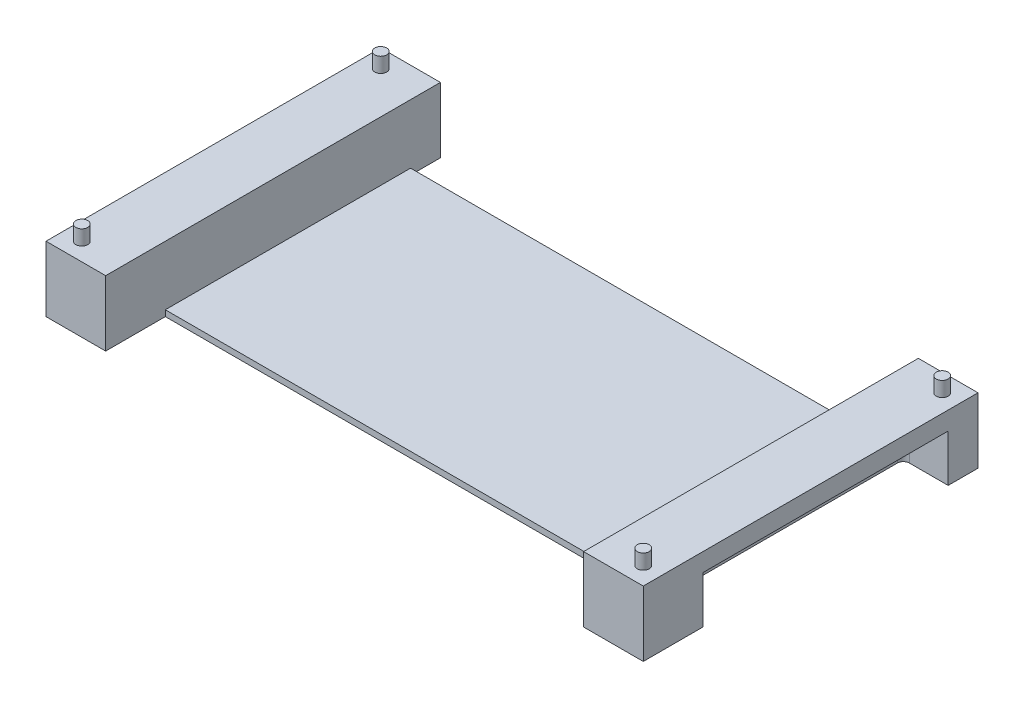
ISO-10303-21;
HEADER;
FILE_DESCRIPTION(('STEP AP214'),'2;1');
FILE_NAME('part.step','',(''),(''),'','','');
FILE_SCHEMA(('AUTOMOTIVE_DESIGN { 1 0 10303 214 1 1 1 1 }'));
ENDSEC;
DATA;
#1=APPLICATION_CONTEXT('core data for automotive mechanical design processes');
#2=APPLICATION_PROTOCOL_DEFINITION('international standard','automotive_design',2000,#1);
#3=PRODUCT_CONTEXT('',#1,'mechanical');
#4=PRODUCT('Part','Part','',(#3));
#5=PRODUCT_RELATED_PRODUCT_CATEGORY('part','',(#4));
#6=PRODUCT_DEFINITION_FORMATION('','',#4);
#7=PRODUCT_DEFINITION_CONTEXT('part definition',#1,'design');
#8=PRODUCT_DEFINITION('design','',#6,#7);
#9=PRODUCT_DEFINITION_SHAPE('','',#8);
#10=(LENGTH_UNIT() NAMED_UNIT(*) SI_UNIT(.MILLI.,.METRE.));
#11=(NAMED_UNIT(*) PLANE_ANGLE_UNIT() SI_UNIT($,.RADIAN.));
#12=(NAMED_UNIT(*) SI_UNIT($,.STERADIAN.) SOLID_ANGLE_UNIT());
#13=UNCERTAINTY_MEASURE_WITH_UNIT(LENGTH_MEASURE(1.E-05),#10,'distance_accuracy_value','');
#14=(GEOMETRIC_REPRESENTATION_CONTEXT(3) GLOBAL_UNCERTAINTY_ASSIGNED_CONTEXT((#13)) GLOBAL_UNIT_ASSIGNED_CONTEXT((#10,
#11,#12)) REPRESENTATION_CONTEXT('',''));
#15=CARTESIAN_POINT('',(0.,0.,0.));
#16=DIRECTION('',(0.,0.,1.));
#17=DIRECTION('',(1.,0.,0.));
#18=AXIS2_PLACEMENT_3D('',#15,#16,#17);
#19=CARTESIAN_POINT('',(80.1,3.05,0.));
#20=DIRECTION('',(1.,0.,0.));
#21=DIRECTION('',(0.,0.,-1.));
#22=AXIS2_PLACEMENT_3D('',#19,#20,#21);
#23=PLANE('',#22);
#24=DIRECTION('',(0.,-1.,0.));
#25=VECTOR('',#24,1.);
#26=CARTESIAN_POINT('',(80.1,-6.9,-41.1));
#27=LINE('',#26,#25);
#28=CARTESIAN_POINT('',(80.1,-6.9,-41.1));
#29=VERTEX_POINT('',#28);
#30=CARTESIAN_POINT('',(80.1,-7.9,-41.1));
#31=VERTEX_POINT('',#30);
#32=EDGE_CURVE('E328',#29,#31,#27,.T.);
#33=ORIENTED_EDGE('',*,*,#32,.F.);
#34=DIRECTION('',(0.,0.,1.));
#35=VECTOR('',#34,1.);
#36=CARTESIAN_POINT('',(80.1,-6.9,0.));
#37=LINE('',#36,#35);
#38=CARTESIAN_POINT('',(80.1,-6.9,0.));
#39=VERTEX_POINT('',#38);
#40=EDGE_CURVE('E310',#29,#39,#37,.T.);
#41=ORIENTED_EDGE('',*,*,#40,.T.);
#42=DIRECTION('',(0.,-1.,0.));
#43=VECTOR('',#42,1.);
#44=CARTESIAN_POINT('',(80.1,-6.9,0.));
#45=LINE('',#44,#43);
#46=CARTESIAN_POINT('',(80.1,-7.9,0.));
#47=VERTEX_POINT('',#46);
#48=EDGE_CURVE('E330',#39,#47,#45,.T.);
#49=ORIENTED_EDGE('',*,*,#48,.T.);
#50=DIRECTION('',(0.,0.,1.));
#51=VECTOR('',#50,1.);
#52=CARTESIAN_POINT('',(80.1,-7.9,0.));
#53=LINE('',#52,#51);
#54=CARTESIAN_POINT('',(80.1,-7.9,10.));
#55=VERTEX_POINT('',#54);
#56=EDGE_CURVE('E347',#47,#55,#53,.T.);
#57=ORIENTED_EDGE('',*,*,#56,.T.);
#58=DIRECTION('',(0.,-1.,0.));
#59=VECTOR('',#58,1.);
#60=CARTESIAN_POINT('',(80.1,3.05,10.));
#61=LINE('',#60,#59);
#62=CARTESIAN_POINT('',(80.1,3.05,10.));
#63=VERTEX_POINT('',#62);
#64=EDGE_CURVE('E365',#63,#55,#61,.T.);
#65=ORIENTED_EDGE('',*,*,#64,.F.);
#66=DIRECTION('',(0.,0.,1.));
#67=VECTOR('',#66,1.);
#68=CARTESIAN_POINT('',(80.1,3.05,0.));
#69=LINE('',#68,#67);
#70=CARTESIAN_POINT('',(80.1,3.05,-46.1));
#71=VERTEX_POINT('',#70);
#72=EDGE_CURVE('E381',#71,#63,#69,.T.);
#73=ORIENTED_EDGE('',*,*,#72,.F.);
#74=DIRECTION('',(0.,-1.,0.));
#75=VECTOR('',#74,1.);
#76=CARTESIAN_POINT('',(80.1,3.05,-46.1));
#77=LINE('',#76,#75);
#78=CARTESIAN_POINT('',(80.1,-7.9,-46.1));
#79=VERTEX_POINT('',#78);
#80=EDGE_CURVE('E374',#71,#79,#77,.T.);
#81=ORIENTED_EDGE('',*,*,#80,.T.);
#82=EDGE_CURVE('E348',#79,#31,#53,.T.);
#83=ORIENTED_EDGE('',*,*,#82,.T.);
#84=EDGE_LOOP('',(#33,#41,#49,#57,#65,#73,#81,#83));
#85=FACE_BOUND('',#84,.T.);
#86=ADVANCED_FACE('F67',(#85),#23,.F.);
#87=CARTESIAN_POINT('',(0.,0.,0.));
#88=DIRECTION('',(0.,1.,0.));
#89=DIRECTION('',(0.,0.,1.));
#90=AXIS2_PLACEMENT_3D('',#87,#88,#89);
#91=PLANE('',#90);
#92=DIRECTION('',(1.,0.,0.));
#93=VECTOR('',#92,1.);
#94=CARTESIAN_POINT('',(0.,0.,0.));
#95=LINE('',#94,#93);
#96=CARTESIAN_POINT('',(83.6,0.,0.));
#97=VERTEX_POINT('',#96);
#98=CARTESIAN_POINT('',(90.1,0.,0.));
#99=VERTEX_POINT('',#98);
#100=EDGE_CURVE('E333',#97,#99,#95,.T.);
#101=ORIENTED_EDGE('',*,*,#100,.F.);
#102=CARTESIAN_POINT('',(83.6,0.,-1.));
#103=DIRECTION('',(0.,1.,0.));
#104=DIRECTION('',(0.,0.,1.));
#105=AXIS2_PLACEMENT_3D('',#102,#103,#104);
#106=CIRCLE('',#105,1.);
#107=CARTESIAN_POINT('',(82.6,0.,-1.));
#108=VERTEX_POINT('',#107);
#109=EDGE_CURVE('E406',#97,#108,#106,.F.);
#110=ORIENTED_EDGE('',*,*,#109,.T.);
#111=DIRECTION('',(0.,0.,1.));
#112=VECTOR('',#111,1.);
#113=CARTESIAN_POINT('',(82.6,0.,0.));
#114=LINE('',#113,#112);
#115=CARTESIAN_POINT('',(82.6,0.,-40.1));
#116=VERTEX_POINT('',#115);
#117=EDGE_CURVE('E359',#116,#108,#114,.T.);
#118=ORIENTED_EDGE('',*,*,#117,.F.);
#119=CARTESIAN_POINT('',(83.6,0.,-40.1));
#120=DIRECTION('',(0.,1.,0.));
#121=DIRECTION('',(0.,0.,1.));
#122=AXIS2_PLACEMENT_3D('',#119,#120,#121);
#123=CIRCLE('',#122,1.);
#124=CARTESIAN_POINT('',(83.6,0.,-41.1));
#125=VERTEX_POINT('',#124);
#126=EDGE_CURVE('E404',#116,#125,#123,.F.);
#127=ORIENTED_EDGE('',*,*,#126,.T.);
#128=DIRECTION('',(1.,0.,0.));
#129=VECTOR('',#128,1.);
#130=CARTESIAN_POINT('',(0.,0.,-41.1));
#131=LINE('',#130,#129);
#132=CARTESIAN_POINT('',(90.1,0.,-41.1));
#133=VERTEX_POINT('',#132);
#134=EDGE_CURVE('E337',#125,#133,#131,.T.);
#135=ORIENTED_EDGE('',*,*,#134,.T.);
#136=DIRECTION('',(0.,0.,-1.));
#137=VECTOR('',#136,1.);
#138=CARTESIAN_POINT('',(90.1,0.,0.));
#139=LINE('',#138,#137);
#140=EDGE_CURVE('E377',#99,#133,#139,.T.);
#141=ORIENTED_EDGE('',*,*,#140,.F.);
#142=EDGE_LOOP('',(#101,#110,#118,#127,#135,#141));
#143=FACE_BOUND('',#142,.T.);
#144=ADVANCED_FACE('F428',(#143),#91,.F.);
#145=CARTESIAN_POINT('',(0.,3.05,10.));
#146=DIRECTION('',(0.,0.,-1.));
#147=DIRECTION('',(-1.,0.,0.));
#148=AXIS2_PLACEMENT_3D('',#145,#146,#147);
#149=PLANE('',#148);
#150=ORIENTED_EDGE('',*,*,#64,.T.);
#151=DIRECTION('',(1.,0.,0.));
#152=VECTOR('',#151,1.);
#153=CARTESIAN_POINT('',(0.,-7.9,10.));
#154=LINE('',#153,#152);
#155=CARTESIAN_POINT('',(90.1,-7.9,10.));
#156=VERTEX_POINT('',#155);
#157=EDGE_CURVE('E351',#55,#156,#154,.T.);
#158=ORIENTED_EDGE('',*,*,#157,.T.);
#159=DIRECTION('',(0.,-1.,0.));
#160=VECTOR('',#159,1.);
#161=CARTESIAN_POINT('',(90.1,3.05,10.));
#162=LINE('',#161,#160);
#163=CARTESIAN_POINT('',(90.1,3.05,10.));
#164=VERTEX_POINT('',#163);
#165=EDGE_CURVE('E370',#164,#156,#162,.T.);
#166=ORIENTED_EDGE('',*,*,#165,.F.);
#167=DIRECTION('',(1.,0.,0.));
#168=VECTOR('',#167,1.);
#169=CARTESIAN_POINT('',(0.,3.05,10.));
#170=LINE('',#169,#168);
#171=EDGE_CURVE('E385',#63,#164,#170,.T.);
#172=ORIENTED_EDGE('',*,*,#171,.F.);
#173=EDGE_LOOP('',(#150,#158,#166,#172));
#174=FACE_BOUND('',#173,.T.);
#175=ADVANCED_FACE('F445',(#174),#149,.F.);
#176=CARTESIAN_POINT('',(90.1,3.05,0.));
#177=DIRECTION('',(-1.,0.,0.));
#178=DIRECTION('',(0.,0.,1.));
#179=AXIS2_PLACEMENT_3D('',#176,#177,#178);
#180=PLANE('',#179);
#181=ORIENTED_EDGE('',*,*,#165,.T.);
#182=DIRECTION('',(0.,0.,-1.));
#183=VECTOR('',#182,1.);
#184=CARTESIAN_POINT('',(90.1,-7.9,0.));
#185=LINE('',#184,#183);
#186=CARTESIAN_POINT('',(90.1,-7.9,0.));
#187=VERTEX_POINT('',#186);
#188=EDGE_CURVE('E354',#156,#187,#185,.T.);
#189=ORIENTED_EDGE('',*,*,#188,.T.);
#190=DIRECTION('',(0.,1.,0.));
#191=VECTOR('',#190,1.);
#192=CARTESIAN_POINT('',(90.1,-7.9,0.));
#193=LINE('',#192,#191);
#194=EDGE_CURVE('E362',#187,#99,#193,.T.);
#195=ORIENTED_EDGE('',*,*,#194,.T.);
#196=ORIENTED_EDGE('',*,*,#140,.T.);
#197=DIRECTION('',(0.,1.,0.));
#198=VECTOR('',#197,1.);
#199=CARTESIAN_POINT('',(90.1,-7.9,-41.1));
#200=LINE('',#199,#198);
#201=CARTESIAN_POINT('',(90.1,-7.9,-41.1));
#202=VERTEX_POINT('',#201);
#203=EDGE_CURVE('E357',#202,#133,#200,.T.);
#204=ORIENTED_EDGE('',*,*,#203,.F.);
#205=DIRECTION('',(0.,0.,-1.));
#206=VECTOR('',#205,1.);
#207=CARTESIAN_POINT('',(90.1,-7.9,0.));
#208=LINE('',#207,#206);
#209=CARTESIAN_POINT('',(90.1,-7.9,-46.1));
#210=VERTEX_POINT('',#209);
#211=EDGE_CURVE('E341',#202,#210,#208,.T.);
#212=ORIENTED_EDGE('',*,*,#211,.T.);
#213=DIRECTION('',(0.,-1.,0.));
#214=VECTOR('',#213,1.);
#215=CARTESIAN_POINT('',(90.1,3.05,-46.1));
#216=LINE('',#215,#214);
#217=CARTESIAN_POINT('',(90.1,3.05,-46.1));
#218=VERTEX_POINT('',#217);
#219=EDGE_CURVE('E372',#218,#210,#216,.T.);
#220=ORIENTED_EDGE('',*,*,#219,.F.);
#221=DIRECTION('',(0.,0.,-1.));
#222=VECTOR('',#221,1.);
#223=CARTESIAN_POINT('',(90.1,3.05,0.));
#224=LINE('',#223,#222);
#225=EDGE_CURVE('E383',#164,#218,#224,.T.);
#226=ORIENTED_EDGE('',*,*,#225,.F.);
#227=EDGE_LOOP('',(#181,#189,#195,#196,#204,#212,#220,#226));
#228=FACE_BOUND('',#227,.T.);
#229=ADVANCED_FACE('F438',(#228),#180,.F.);
#230=CARTESIAN_POINT('',(0.,3.05,-46.1));
#231=DIRECTION('',(0.,0.,1.));
#232=DIRECTION('',(1.,0.,0.));
#233=AXIS2_PLACEMENT_3D('',#230,#231,#232);
#234=PLANE('',#233);
#235=ORIENTED_EDGE('',*,*,#219,.T.);
#236=DIRECTION('',(-1.,0.,0.));
#237=VECTOR('',#236,1.);
#238=CARTESIAN_POINT('',(0.,-7.9,-46.1));
#239=LINE('',#238,#237);
#240=EDGE_CURVE('E344',#210,#79,#239,.T.);
#241=ORIENTED_EDGE('',*,*,#240,.T.);
#242=ORIENTED_EDGE('',*,*,#80,.F.);
#243=DIRECTION('',(-1.,0.,0.));
#244=VECTOR('',#243,1.);
#245=CARTESIAN_POINT('',(0.,3.05,-46.1));
#246=LINE('',#245,#244);
#247=EDGE_CURVE('E376',#218,#71,#246,.T.);
#248=ORIENTED_EDGE('',*,*,#247,.F.);
#249=EDGE_LOOP('',(#235,#241,#242,#248));
#250=FACE_BOUND('',#249,.T.);
#251=ADVANCED_FACE('F511',(#250),#234,.F.);
#252=CARTESIAN_POINT('',(0.,3.05,0.));
#253=DIRECTION('',(0.,1.,0.));
#254=DIRECTION('',(0.,0.,1.));
#255=AXIS2_PLACEMENT_3D('',#252,#253,#254);
#256=PLANE('',#255);
#257=CARTESIAN_POINT('',(87.1,3.05,-43.1));
#258=DIRECTION('',(0.,1.,0.));
#259=DIRECTION('',(0.,0.,1.));
#260=AXIS2_PLACEMENT_3D('',#257,#258,#259);
#261=CIRCLE('',#260,1.00000000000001);
#262=CARTESIAN_POINT('',(87.1,3.05,-42.1));
#263=VERTEX_POINT('',#262);
#264=EDGE_CURVE('E524',#263,#263,#261,.T.);
#265=ORIENTED_EDGE('',*,*,#264,.F.);
#266=EDGE_LOOP('',(#265));
#267=FACE_BOUND('',#266,.T.);
#268=CARTESIAN_POINT('',(87.1,3.05,7.));
#269=DIRECTION('',(0.,1.,0.));
#270=DIRECTION('',(0.,0.,1.));
#271=AXIS2_PLACEMENT_3D('',#268,#269,#270);
#272=CIRCLE('',#271,1.00000000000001);
#273=CARTESIAN_POINT('',(87.1,3.05,8.00000000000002));
#274=VERTEX_POINT('',#273);
#275=EDGE_CURVE('E528',#274,#274,#272,.T.);
#276=ORIENTED_EDGE('',*,*,#275,.F.);
#277=EDGE_LOOP('',(#276));
#278=FACE_BOUND('',#277,.T.);
#279=ORIENTED_EDGE('',*,*,#72,.T.);
#280=ORIENTED_EDGE('',*,*,#171,.T.);
#281=ORIENTED_EDGE('',*,*,#225,.T.);
#282=ORIENTED_EDGE('',*,*,#247,.T.);
#283=EDGE_LOOP('',(#279,#280,#281,#282));
#284=FACE_BOUND('',#283,.T.);
#285=ADVANCED_FACE('F513',(#267,#278,#284),#256,.T.);
#286=CARTESIAN_POINT('',(0.,-7.9,0.));
#287=DIRECTION('',(0.,0.,1.));
#288=DIRECTION('',(1.,0.,0.));
#289=AXIS2_PLACEMENT_3D('',#286,#287,#288);
#290=PLANE('',#289);
#291=DIRECTION('',(1.,0.,0.));
#292=VECTOR('',#291,1.);
#293=CARTESIAN_POINT('',(0.,-7.9,0.));
#294=LINE('',#293,#292);
#295=CARTESIAN_POINT('',(83.6,-7.9,0.));
#296=VERTEX_POINT('',#295);
#297=EDGE_CURVE('E334',#296,#187,#294,.T.);
#298=ORIENTED_EDGE('',*,*,#297,.F.);
#299=DIRECTION('',(0.,1.,0.));
#300=VECTOR('',#299,1.);
#301=CARTESIAN_POINT('',(83.6,0.,0.));
#302=LINE('',#301,#300);
#303=EDGE_CURVE('E401',#296,#97,#302,.T.);
#304=ORIENTED_EDGE('',*,*,#303,.T.);
#305=ORIENTED_EDGE('',*,*,#100,.T.);
#306=ORIENTED_EDGE('',*,*,#194,.F.);
#307=EDGE_LOOP('',(#298,#304,#305,#306));
#308=FACE_BOUND('',#307,.T.);
#309=ADVANCED_FACE('F423',(#308),#290,.F.);
#310=CARTESIAN_POINT('',(0.,-7.9,-41.1));
#311=DIRECTION('',(0.,0.,1.));
#312=DIRECTION('',(1.,0.,0.));
#313=AXIS2_PLACEMENT_3D('',#310,#311,#312);
#314=PLANE('',#313);
#315=ORIENTED_EDGE('',*,*,#134,.F.);
#316=DIRECTION('',(0.,1.,0.));
#317=VECTOR('',#316,1.);
#318=CARTESIAN_POINT('',(83.6,-7.9,-41.1));
#319=LINE('',#318,#317);
#320=CARTESIAN_POINT('',(83.6,-7.9,-41.1));
#321=VERTEX_POINT('',#320);
#322=EDGE_CURVE('E82',#125,#321,#319,.F.);
#323=ORIENTED_EDGE('',*,*,#322,.T.);
#324=DIRECTION('',(1.,0.,0.));
#325=VECTOR('',#324,1.);
#326=CARTESIAN_POINT('',(0.,-7.9,-41.1));
#327=LINE('',#326,#325);
#328=EDGE_CURVE('E339',#321,#202,#327,.T.);
#329=ORIENTED_EDGE('',*,*,#328,.T.);
#330=ORIENTED_EDGE('',*,*,#203,.T.);
#331=EDGE_LOOP('',(#315,#323,#329,#330));
#332=FACE_BOUND('',#331,.T.);
#333=ADVANCED_FACE('F434',(#332),#314,.T.);
#334=CARTESIAN_POINT('',(82.6,-7.9,0.));
#335=DIRECTION('',(-1.,0.,0.));
#336=DIRECTION('',(0.,0.,1.));
#337=AXIS2_PLACEMENT_3D('',#334,#335,#336);
#338=PLANE('',#337);
#339=ORIENTED_EDGE('',*,*,#117,.T.);
#340=DIRECTION('',(0.,1.,0.));
#341=VECTOR('',#340,1.);
#342=CARTESIAN_POINT('',(82.6,-7.9,-1.));
#343=LINE('',#342,#341);
#344=CARTESIAN_POINT('',(82.6,-7.9,-1.));
#345=VERTEX_POINT('',#344);
#346=EDGE_CURVE('E90',#108,#345,#343,.F.);
#347=ORIENTED_EDGE('',*,*,#346,.T.);
#348=DIRECTION('',(0.,0.,1.));
#349=VECTOR('',#348,1.);
#350=CARTESIAN_POINT('',(82.6,-7.9,0.));
#351=LINE('',#350,#349);
#352=CARTESIAN_POINT('',(82.6,-7.9,-40.1));
#353=VERTEX_POINT('',#352);
#354=EDGE_CURVE('E336',#353,#345,#351,.T.);
#355=ORIENTED_EDGE('',*,*,#354,.F.);
#356=DIRECTION('',(0.,1.,0.));
#357=VECTOR('',#356,1.);
#358=CARTESIAN_POINT('',(82.6,-7.9,-40.1));
#359=LINE('',#358,#357);
#360=EDGE_CURVE('E408',#353,#116,#359,.T.);
#361=ORIENTED_EDGE('',*,*,#360,.T.);
#362=EDGE_LOOP('',(#339,#347,#355,#361));
#363=FACE_BOUND('',#362,.T.);
#364=ADVANCED_FACE('F430',(#363),#338,.F.);
#365=CARTESIAN_POINT('',(0.,-7.9,0.));
#366=DIRECTION('',(0.,1.,0.));
#367=DIRECTION('',(0.,0.,1.));
#368=AXIS2_PLACEMENT_3D('',#365,#366,#367);
#369=PLANE('',#368);
#370=CARTESIAN_POINT('',(-7.,-7.9,-43.1));
#371=DIRECTION('',(0.,1.,0.));
#372=DIRECTION('',(0.,0.,1.));
#373=AXIS2_PLACEMENT_3D('',#370,#371,#372);
#374=CIRCLE('',#373,1.);
#375=CARTESIAN_POINT('',(-7.,-7.9,-42.1));
#376=VERTEX_POINT('',#375);
#377=EDGE_CURVE('E1018',#376,#376,#374,.T.);
#378=ORIENTED_EDGE('',*,*,#377,.T.);
#379=EDGE_LOOP('',(#378));
#380=FACE_BOUND('',#379,.T.);
#381=CARTESIAN_POINT('',(-7.,-7.9,7.));
#382=DIRECTION('',(0.,1.,0.));
#383=DIRECTION('',(0.,0.,1.));
#384=AXIS2_PLACEMENT_3D('',#381,#382,#383);
#385=CIRCLE('',#384,1.);
#386=CARTESIAN_POINT('',(-7.,-7.9,8.));
#387=VERTEX_POINT('',#386);
#388=EDGE_CURVE('E1024',#387,#387,#385,.T.);
#389=ORIENTED_EDGE('',*,*,#388,.T.);
#390=EDGE_LOOP('',(#389));
#391=FACE_BOUND('',#390,.T.);
#392=CARTESIAN_POINT('',(87.1,-7.9,-43.1));
#393=DIRECTION('',(0.,1.,0.));
#394=DIRECTION('',(0.,0.,1.));
#395=AXIS2_PLACEMENT_3D('',#392,#393,#394);
#396=CIRCLE('',#395,1.00000000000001);
#397=CARTESIAN_POINT('',(87.1,-7.9,-42.1));
#398=VERTEX_POINT('',#397);
#399=EDGE_CURVE('E1030',#398,#398,#396,.T.);
#400=ORIENTED_EDGE('',*,*,#399,.T.);
#401=EDGE_LOOP('',(#400));
#402=FACE_BOUND('',#401,.T.);
#403=CARTESIAN_POINT('',(87.1,-7.9,7.));
#404=DIRECTION('',(0.,1.,0.));
#405=DIRECTION('',(0.,0.,1.));
#406=AXIS2_PLACEMENT_3D('',#403,#404,#405);
#407=CIRCLE('',#406,1.00000000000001);
#408=CARTESIAN_POINT('',(87.1,-7.9,8.00000000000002));
#409=VERTEX_POINT('',#408);
#410=EDGE_CURVE('E262',#409,#409,#407,.T.);
#411=ORIENTED_EDGE('',*,*,#410,.T.);
#412=EDGE_LOOP('',(#411));
#413=FACE_BOUND('',#412,.T.);
#414=ORIENTED_EDGE('',*,*,#354,.T.);
#415=CARTESIAN_POINT('',(83.6,-7.9,-1.));
#416=DIRECTION('',(0.,1.,0.));
#417=DIRECTION('',(0.,0.,1.));
#418=AXIS2_PLACEMENT_3D('',#415,#416,#417);
#419=CIRCLE('',#418,1.);
#420=EDGE_CURVE('E75',#345,#296,#419,.T.);
#421=ORIENTED_EDGE('',*,*,#420,.T.);
#422=ORIENTED_EDGE('',*,*,#297,.T.);
#423=ORIENTED_EDGE('',*,*,#188,.F.);
#424=ORIENTED_EDGE('',*,*,#157,.F.);
#425=ORIENTED_EDGE('',*,*,#56,.F.);
#426=DIRECTION('',(1.,0.,0.));
#427=VECTOR('',#426,1.);
#428=CARTESIAN_POINT('',(0.,-7.9,0.));
#429=LINE('',#428,#427);
#430=CARTESIAN_POINT('',(0.,-7.9,0.));
#431=VERTEX_POINT('',#430);
#432=EDGE_CURVE('E307',#431,#47,#429,.T.);
#433=ORIENTED_EDGE('',*,*,#432,.F.);
#434=DIRECTION('',(0.,0.,1.));
#435=VECTOR('',#434,1.);
#436=CARTESIAN_POINT('',(0.,-7.9,0.));
#437=LINE('',#436,#435);
#438=CARTESIAN_POINT('',(0.,-7.9,10.));
#439=VERTEX_POINT('',#438);
#440=EDGE_CURVE('E266',#431,#439,#437,.T.);
#441=ORIENTED_EDGE('',*,*,#440,.T.);
#442=DIRECTION('',(-1.,0.,0.));
#443=VECTOR('',#442,1.);
#444=CARTESIAN_POINT('',(0.,-7.9,10.));
#445=LINE('',#444,#443);
#446=CARTESIAN_POINT('',(-10.,-7.9,10.));
#447=VERTEX_POINT('',#446);
#448=EDGE_CURVE('E238',#439,#447,#445,.T.);
#449=ORIENTED_EDGE('',*,*,#448,.T.);
#450=DIRECTION('',(0.,0.,-1.));
#451=VECTOR('',#450,1.);
#452=CARTESIAN_POINT('',(-10.,-7.9,0.));
#453=LINE('',#452,#451);
#454=CARTESIAN_POINT('',(-10.,-7.9,0.));
#455=VERTEX_POINT('',#454);
#456=EDGE_CURVE('E231',#447,#455,#453,.T.);
#457=ORIENTED_EDGE('',*,*,#456,.T.);
#458=DIRECTION('',(1.,0.,0.));
#459=VECTOR('',#458,1.);
#460=CARTESIAN_POINT('',(0.,-7.9,0.));
#461=LINE('',#460,#459);
#462=CARTESIAN_POINT('',(-3.5,-7.9,0.));
#463=VERTEX_POINT('',#462);
#464=EDGE_CURVE('E235',#455,#463,#461,.T.);
#465=ORIENTED_EDGE('',*,*,#464,.T.);
#466=CARTESIAN_POINT('',(-3.5,-7.9,-1.));
#467=DIRECTION('',(0.,1.,0.));
#468=DIRECTION('',(0.,0.,1.));
#469=AXIS2_PLACEMENT_3D('',#466,#467,#468);
#470=CIRCLE('',#469,1.);
#471=CARTESIAN_POINT('',(-2.5,-7.9,-1.));
#472=VERTEX_POINT('',#471);
#473=EDGE_CURVE('E413',#463,#472,#470,.T.);
#474=ORIENTED_EDGE('',*,*,#473,.T.);
#475=DIRECTION('',(0.,0.,1.));
#476=VECTOR('',#475,1.);
#477=CARTESIAN_POINT('',(-2.5,-7.9,0.));
#478=LINE('',#477,#476);
#479=CARTESIAN_POINT('',(-2.5,-7.9,-40.1));
#480=VERTEX_POINT('',#479);
#481=EDGE_CURVE('E251',#480,#472,#478,.T.);
#482=ORIENTED_EDGE('',*,*,#481,.F.);
#483=CARTESIAN_POINT('',(-3.5,-7.9,-40.1));
#484=DIRECTION('',(0.,1.,0.));
#485=DIRECTION('',(0.,0.,1.));
#486=AXIS2_PLACEMENT_3D('',#483,#484,#485);
#487=CIRCLE('',#486,1.);
#488=CARTESIAN_POINT('',(-3.5,-7.9,-41.1));
#489=VERTEX_POINT('',#488);
#490=EDGE_CURVE('E415',#480,#489,#487,.T.);
#491=ORIENTED_EDGE('',*,*,#490,.T.);
#492=DIRECTION('',(-1.,0.,0.));
#493=VECTOR('',#492,1.);
#494=CARTESIAN_POINT('',(0.,-7.9,-41.1));
#495=LINE('',#494,#493);
#496=CARTESIAN_POINT('',(-10.,-7.9,-41.1));
#497=VERTEX_POINT('',#496);
#498=EDGE_CURVE('E276',#489,#497,#495,.T.);
#499=ORIENTED_EDGE('',*,*,#498,.T.);
#500=DIRECTION('',(0.,0.,-1.));
#501=VECTOR('',#500,1.);
#502=CARTESIAN_POINT('',(-10.,-7.9,0.));
#503=LINE('',#502,#501);
#504=CARTESIAN_POINT('',(-10.,-7.9,-46.1));
#505=VERTEX_POINT('',#504);
#506=EDGE_CURVE('E273',#497,#505,#503,.T.);
#507=ORIENTED_EDGE('',*,*,#506,.T.);
#508=DIRECTION('',(1.,0.,0.));
#509=VECTOR('',#508,1.);
#510=CARTESIAN_POINT('',(0.,-7.9,-46.1));
#511=LINE('',#510,#509);
#512=CARTESIAN_POINT('',(0.,-7.9,-46.1));
#513=VERTEX_POINT('',#512);
#514=EDGE_CURVE('E270',#505,#513,#511,.T.);
#515=ORIENTED_EDGE('',*,*,#514,.T.);
#516=CARTESIAN_POINT('',(0.,-7.9,-41.1));
#517=VERTEX_POINT('',#516);
#518=EDGE_CURVE('E267',#513,#517,#437,.T.);
#519=ORIENTED_EDGE('',*,*,#518,.T.);
#520=DIRECTION('',(1.,0.,0.));
#521=VECTOR('',#520,1.);
#522=CARTESIAN_POINT('',(0.,-7.9,-41.1));
#523=LINE('',#522,#521);
#524=EDGE_CURVE('E311',#517,#31,#523,.T.);
#525=ORIENTED_EDGE('',*,*,#524,.T.);
#526=ORIENTED_EDGE('',*,*,#82,.F.);
#527=ORIENTED_EDGE('',*,*,#240,.F.);
#528=ORIENTED_EDGE('',*,*,#211,.F.);
#529=ORIENTED_EDGE('',*,*,#328,.F.);
#530=CARTESIAN_POINT('',(83.6,-7.9,-40.1));
#531=DIRECTION('',(0.,1.,0.));
#532=DIRECTION('',(0.,0.,1.));
#533=AXIS2_PLACEMENT_3D('',#530,#531,#532);
#534=CIRCLE('',#533,1.);
#535=EDGE_CURVE('E12',#321,#353,#534,.T.);
#536=ORIENTED_EDGE('',*,*,#535,.T.);
#537=EDGE_LOOP('',(#414,#421,#422,#423,#424,#425,#433,#441,#449,#457,#465,#474,#482,#491,#499,
#507,#515,#519,#525,#526,#527,#528,#529,#536));
#538=FACE_BOUND('',#537,.T.);
#539=ADVANCED_FACE('F233',(#380,#391,#402,#413,#538),#369,.F.);
#540=CARTESIAN_POINT('',(0.,-6.9,0.));
#541=DIRECTION('',(0.,0.,-1.));
#542=DIRECTION('',(-1.,0.,0.));
#543=AXIS2_PLACEMENT_3D('',#540,#541,#542);
#544=PLANE('',#543);
#545=ORIENTED_EDGE('',*,*,#432,.T.);
#546=ORIENTED_EDGE('',*,*,#48,.F.);
#547=DIRECTION('',(1.,0.,0.));
#548=VECTOR('',#547,1.);
#549=CARTESIAN_POINT('',(0.,-6.9,0.));
#550=LINE('',#549,#548);
#551=CARTESIAN_POINT('',(0.,-6.9,0.));
#552=VERTEX_POINT('',#551);
#553=EDGE_CURVE('E308',#552,#39,#550,.T.);
#554=ORIENTED_EDGE('',*,*,#553,.F.);
#555=DIRECTION('',(0.,-1.,0.));
#556=VECTOR('',#555,1.);
#557=CARTESIAN_POINT('',(0.,-6.9,0.));
#558=LINE('',#557,#556);
#559=EDGE_CURVE('E320',#552,#431,#558,.T.);
#560=ORIENTED_EDGE('',*,*,#559,.T.);
#561=EDGE_LOOP('',(#545,#546,#554,#560));
#562=FACE_BOUND('',#561,.T.);
#563=ADVANCED_FACE('F452',(#562),#544,.F.);
#564=CARTESIAN_POINT('',(0.,-6.9,-41.1));
#565=DIRECTION('',(0.,0.,-1.));
#566=DIRECTION('',(-1.,0.,0.));
#567=AXIS2_PLACEMENT_3D('',#564,#565,#566);
#568=PLANE('',#567);
#569=ORIENTED_EDGE('',*,*,#524,.F.);
#570=DIRECTION('',(0.,-1.,0.));
#571=VECTOR('',#570,1.);
#572=CARTESIAN_POINT('',(0.,-6.9,-41.1));
#573=LINE('',#572,#571);
#574=CARTESIAN_POINT('',(0.,-6.9,-41.1));
#575=VERTEX_POINT('',#574);
#576=EDGE_CURVE('E325',#575,#517,#573,.T.);
#577=ORIENTED_EDGE('',*,*,#576,.F.);
#578=DIRECTION('',(1.,0.,0.));
#579=VECTOR('',#578,1.);
#580=CARTESIAN_POINT('',(0.,-6.9,-41.1));
#581=LINE('',#580,#579);
#582=EDGE_CURVE('E314',#575,#29,#581,.T.);
#583=ORIENTED_EDGE('',*,*,#582,.T.);
#584=ORIENTED_EDGE('',*,*,#32,.T.);
#585=EDGE_LOOP('',(#569,#577,#583,#584));
#586=FACE_BOUND('',#585,.T.);
#587=ADVANCED_FACE('F535',(#586),#568,.T.);
#588=CARTESIAN_POINT('',(0.,-6.9,0.));
#589=DIRECTION('',(0.,-1.,0.));
#590=DIRECTION('',(0.,0.,-1.));
#591=AXIS2_PLACEMENT_3D('',#588,#589,#590);
#592=PLANE('',#591);
#593=ORIENTED_EDGE('',*,*,#553,.T.);
#594=ORIENTED_EDGE('',*,*,#40,.F.);
#595=ORIENTED_EDGE('',*,*,#582,.F.);
#596=DIRECTION('',(0.,0.,-1.));
#597=VECTOR('',#596,1.);
#598=CARTESIAN_POINT('',(0.,-6.9,0.));
#599=LINE('',#598,#597);
#600=EDGE_CURVE('E317',#552,#575,#599,.T.);
#601=ORIENTED_EDGE('',*,*,#600,.F.);
#602=EDGE_LOOP('',(#593,#594,#595,#601));
#603=FACE_BOUND('',#602,.T.);
#604=ADVANCED_FACE('F538',(#603),#592,.F.);
#605=CARTESIAN_POINT('',(0.,3.05,0.));
#606=DIRECTION('',(1.,0.,0.));
#607=DIRECTION('',(0.,0.,-1.));
#608=AXIS2_PLACEMENT_3D('',#605,#606,#607);
#609=PLANE('',#608);
#610=ORIENTED_EDGE('',*,*,#559,.F.);
#611=ORIENTED_EDGE('',*,*,#600,.T.);
#612=ORIENTED_EDGE('',*,*,#576,.T.);
#613=ORIENTED_EDGE('',*,*,#518,.F.);
#614=DIRECTION('',(0.,-1.,0.));
#615=VECTOR('',#614,1.);
#616=CARTESIAN_POINT('',(0.,3.05,-46.1));
#617=LINE('',#616,#615);
#618=CARTESIAN_POINT('',(0.,3.05,-46.1));
#619=VERTEX_POINT('',#618);
#620=EDGE_CURVE('E300',#619,#513,#617,.T.);
#621=ORIENTED_EDGE('',*,*,#620,.F.);
#622=DIRECTION('',(0.,0.,1.));
#623=VECTOR('',#622,1.);
#624=CARTESIAN_POINT('',(0.,3.05,0.));
#625=LINE('',#624,#623);
#626=CARTESIAN_POINT('',(0.,3.05,10.));
#627=VERTEX_POINT('',#626);
#628=EDGE_CURVE('E291',#619,#627,#625,.T.);
#629=ORIENTED_EDGE('',*,*,#628,.T.);
#630=DIRECTION('',(0.,-1.,0.));
#631=VECTOR('',#630,1.);
#632=CARTESIAN_POINT('',(0.,3.05,10.));
#633=LINE('',#632,#631);
#634=EDGE_CURVE('E302',#627,#439,#633,.T.);
#635=ORIENTED_EDGE('',*,*,#634,.T.);
#636=ORIENTED_EDGE('',*,*,#440,.F.);
#637=EDGE_LOOP('',(#610,#611,#612,#613,#621,#629,#635,#636));
#638=FACE_BOUND('',#637,.T.);
#639=ADVANCED_FACE('F457',(#638),#609,.T.);
#640=CARTESIAN_POINT('',(0.,0.,0.));
#641=DIRECTION('',(0.,1.,0.));
#642=DIRECTION('',(0.,0.,1.));
#643=AXIS2_PLACEMENT_3D('',#640,#641,#642);
#644=PLANE('',#643);
#645=DIRECTION('',(0.,0.,1.));
#646=VECTOR('',#645,1.);
#647=CARTESIAN_POINT('',(-2.5,0.,0.));
#648=LINE('',#647,#646);
#649=CARTESIAN_POINT('',(-2.5,0.,-40.1));
#650=VERTEX_POINT('',#649);
#651=CARTESIAN_POINT('',(-2.5,0.,-1.));
#652=VERTEX_POINT('',#651);
#653=EDGE_CURVE('E256',#650,#652,#648,.T.);
#654=ORIENTED_EDGE('',*,*,#653,.T.);
#655=CARTESIAN_POINT('',(-3.5,0.,-1.));
#656=DIRECTION('',(0.,1.,0.));
#657=DIRECTION('',(0.,0.,1.));
#658=AXIS2_PLACEMENT_3D('',#655,#656,#657);
#659=CIRCLE('',#658,1.);
#660=CARTESIAN_POINT('',(-3.5,0.,0.));
#661=VERTEX_POINT('',#660);
#662=EDGE_CURVE('E395',#652,#661,#659,.F.);
#663=ORIENTED_EDGE('',*,*,#662,.T.);
#664=DIRECTION('',(1.,0.,0.));
#665=VECTOR('',#664,1.);
#666=CARTESIAN_POINT('',(0.,0.,0.));
#667=LINE('',#666,#665);
#668=CARTESIAN_POINT('',(-10.,0.,0.));
#669=VERTEX_POINT('',#668);
#670=EDGE_CURVE('E280',#669,#661,#667,.T.);
#671=ORIENTED_EDGE('',*,*,#670,.F.);
#672=DIRECTION('',(0.,0.,-1.));
#673=VECTOR('',#672,1.);
#674=CARTESIAN_POINT('',(-10.,0.,0.));
#675=LINE('',#674,#673);
#676=CARTESIAN_POINT('',(-10.,0.,-41.1));
#677=VERTEX_POINT('',#676);
#678=EDGE_CURVE('E246',#669,#677,#675,.T.);
#679=ORIENTED_EDGE('',*,*,#678,.T.);
#680=DIRECTION('',(-1.,0.,0.));
#681=VECTOR('',#680,1.);
#682=CARTESIAN_POINT('',(0.,0.,-41.1));
#683=LINE('',#682,#681);
#684=CARTESIAN_POINT('',(-3.5,0.,-41.1));
#685=VERTEX_POINT('',#684);
#686=EDGE_CURVE('E259',#685,#677,#683,.T.);
#687=ORIENTED_EDGE('',*,*,#686,.F.);
#688=CARTESIAN_POINT('',(-3.5,0.,-40.1));
#689=DIRECTION('',(0.,1.,0.));
#690=DIRECTION('',(0.,0.,1.));
#691=AXIS2_PLACEMENT_3D('',#688,#689,#690);
#692=CIRCLE('',#691,1.);
#693=EDGE_CURVE('E393',#685,#650,#692,.F.);
#694=ORIENTED_EDGE('',*,*,#693,.T.);
#695=EDGE_LOOP('',(#654,#663,#671,#679,#687,#694));
#696=FACE_BOUND('',#695,.T.);
#697=ADVANCED_FACE('F480',(#696),#644,.F.);
#698=CARTESIAN_POINT('',(-10.,3.05,0.));
#699=DIRECTION('',(-1.,0.,0.));
#700=DIRECTION('',(0.,0.,1.));
#701=AXIS2_PLACEMENT_3D('',#698,#699,#700);
#702=PLANE('',#701);
#703=ORIENTED_EDGE('',*,*,#678,.F.);
#704=DIRECTION('',(0.,1.,0.));
#705=VECTOR('',#704,1.);
#706=CARTESIAN_POINT('',(-10.,-7.9,0.));
#707=LINE('',#706,#705);
#708=EDGE_CURVE('E242',#455,#669,#707,.T.);
#709=ORIENTED_EDGE('',*,*,#708,.F.);
#710=ORIENTED_EDGE('',*,*,#456,.F.);
#711=DIRECTION('',(0.,-1.,0.));
#712=VECTOR('',#711,1.);
#713=CARTESIAN_POINT('',(-10.,3.05,10.));
#714=LINE('',#713,#712);
#715=CARTESIAN_POINT('',(-10.,3.05,10.));
#716=VERTEX_POINT('',#715);
#717=EDGE_CURVE('E305',#716,#447,#714,.T.);
#718=ORIENTED_EDGE('',*,*,#717,.F.);
#719=DIRECTION('',(0.,0.,-1.));
#720=VECTOR('',#719,1.);
#721=CARTESIAN_POINT('',(-10.,3.05,0.));
#722=LINE('',#721,#720);
#723=CARTESIAN_POINT('',(-10.,3.05,-46.1));
#724=VERTEX_POINT('',#723);
#725=EDGE_CURVE('E285',#716,#724,#722,.T.);
#726=ORIENTED_EDGE('',*,*,#725,.T.);
#727=DIRECTION('',(0.,-1.,0.));
#728=VECTOR('',#727,1.);
#729=CARTESIAN_POINT('',(-10.,3.05,-46.1));
#730=LINE('',#729,#728);
#731=EDGE_CURVE('E297',#724,#505,#730,.T.);
#732=ORIENTED_EDGE('',*,*,#731,.T.);
#733=ORIENTED_EDGE('',*,*,#506,.F.);
#734=DIRECTION('',(0.,1.,0.));
#735=VECTOR('',#734,1.);
#736=CARTESIAN_POINT('',(-10.,-7.9,-41.1));
#737=LINE('',#736,#735);
#738=EDGE_CURVE('E250',#497,#677,#737,.T.);
#739=ORIENTED_EDGE('',*,*,#738,.T.);
#740=EDGE_LOOP('',(#703,#709,#710,#718,#726,#732,#733,#739));
#741=FACE_BOUND('',#740,.T.);
#742=ADVANCED_FACE('F243',(#741),#702,.T.);
#743=CARTESIAN_POINT('',(0.,3.05,10.));
#744=DIRECTION('',(0.,0.,1.));
#745=DIRECTION('',(1.,0.,0.));
#746=AXIS2_PLACEMENT_3D('',#743,#744,#745);
#747=PLANE('',#746);
#748=ORIENTED_EDGE('',*,*,#717,.T.);
#749=ORIENTED_EDGE('',*,*,#448,.F.);
#750=ORIENTED_EDGE('',*,*,#634,.F.);
#751=DIRECTION('',(-1.,0.,0.));
#752=VECTOR('',#751,1.);
#753=CARTESIAN_POINT('',(0.,3.05,10.));
#754=LINE('',#753,#752);
#755=EDGE_CURVE('E288',#627,#716,#754,.T.);
#756=ORIENTED_EDGE('',*,*,#755,.T.);
#757=EDGE_LOOP('',(#748,#749,#750,#756));
#758=FACE_BOUND('',#757,.T.);
#759=ADVANCED_FACE('F461',(#758),#747,.T.);
#760=CARTESIAN_POINT('',(0.,3.05,-46.1));
#761=DIRECTION('',(0.,0.,-1.));
#762=DIRECTION('',(-1.,0.,0.));
#763=AXIS2_PLACEMENT_3D('',#760,#761,#762);
#764=PLANE('',#763);
#765=ORIENTED_EDGE('',*,*,#620,.T.);
#766=ORIENTED_EDGE('',*,*,#514,.F.);
#767=ORIENTED_EDGE('',*,*,#731,.F.);
#768=DIRECTION('',(1.,0.,0.));
#769=VECTOR('',#768,1.);
#770=CARTESIAN_POINT('',(0.,3.05,-46.1));
#771=LINE('',#770,#769);
#772=EDGE_CURVE('E294',#724,#619,#771,.T.);
#773=ORIENTED_EDGE('',*,*,#772,.T.);
#774=EDGE_LOOP('',(#765,#766,#767,#773));
#775=FACE_BOUND('',#774,.T.);
#776=ADVANCED_FACE('F467',(#775),#764,.T.);
#777=CARTESIAN_POINT('',(0.,3.05,0.));
#778=DIRECTION('',(0.,1.,0.));
#779=DIRECTION('',(0.,0.,1.));
#780=AXIS2_PLACEMENT_3D('',#777,#778,#779);
#781=PLANE('',#780);
#782=CARTESIAN_POINT('',(-7.,3.05,7.));
#783=DIRECTION('',(0.,1.,0.));
#784=DIRECTION('',(0.,0.,1.));
#785=AXIS2_PLACEMENT_3D('',#782,#783,#784);
#786=CIRCLE('',#785,1.);
#787=CARTESIAN_POINT('',(-7.,3.05,8.));
#788=VERTEX_POINT('',#787);
#789=EDGE_CURVE('E998',#788,#788,#786,.T.);
#790=ORIENTED_EDGE('',*,*,#789,.F.);
#791=EDGE_LOOP('',(#790));
#792=FACE_BOUND('',#791,.T.);
#793=CARTESIAN_POINT('',(-7.,3.05,-43.1));
#794=DIRECTION('',(0.,1.,0.));
#795=DIRECTION('',(0.,0.,1.));
#796=AXIS2_PLACEMENT_3D('',#793,#794,#795);
#797=CIRCLE('',#796,1.);
#798=CARTESIAN_POINT('',(-7.,3.05,-42.1));
#799=VERTEX_POINT('',#798);
#800=EDGE_CURVE('E1008',#799,#799,#797,.T.);
#801=ORIENTED_EDGE('',*,*,#800,.F.);
#802=EDGE_LOOP('',(#801));
#803=FACE_BOUND('',#802,.T.);
#804=ORIENTED_EDGE('',*,*,#725,.F.);
#805=ORIENTED_EDGE('',*,*,#755,.F.);
#806=ORIENTED_EDGE('',*,*,#628,.F.);
#807=ORIENTED_EDGE('',*,*,#772,.F.);
#808=EDGE_LOOP('',(#804,#805,#806,#807));
#809=FACE_BOUND('',#808,.T.);
#810=ADVANCED_FACE('F465',(#792,#803,#809),#781,.T.);
#811=CARTESIAN_POINT('',(0.,-7.9,0.));
#812=DIRECTION('',(0.,0.,1.));
#813=DIRECTION('',(1.,0.,0.));
#814=AXIS2_PLACEMENT_3D('',#811,#812,#813);
#815=PLANE('',#814);
#816=ORIENTED_EDGE('',*,*,#670,.T.);
#817=DIRECTION('',(0.,1.,0.));
#818=VECTOR('',#817,1.);
#819=CARTESIAN_POINT('',(-3.5,-7.9,0.));
#820=LINE('',#819,#818);
#821=EDGE_CURVE('E255',#661,#463,#820,.F.);
#822=ORIENTED_EDGE('',*,*,#821,.T.);
#823=ORIENTED_EDGE('',*,*,#464,.F.);
#824=ORIENTED_EDGE('',*,*,#708,.T.);
#825=EDGE_LOOP('',(#816,#822,#823,#824));
#826=FACE_BOUND('',#825,.T.);
#827=ADVANCED_FACE('F253',(#826),#815,.F.);
#828=CARTESIAN_POINT('',(-2.5,-7.9,0.));
#829=DIRECTION('',(-1.,0.,0.));
#830=DIRECTION('',(0.,0.,1.));
#831=AXIS2_PLACEMENT_3D('',#828,#829,#830);
#832=PLANE('',#831);
#833=ORIENTED_EDGE('',*,*,#481,.T.);
#834=DIRECTION('',(0.,1.,0.));
#835=VECTOR('',#834,1.);
#836=CARTESIAN_POINT('',(-2.5,-7.9,-1.));
#837=LINE('',#836,#835);
#838=EDGE_CURVE('E390',#472,#652,#837,.T.);
#839=ORIENTED_EDGE('',*,*,#838,.T.);
#840=ORIENTED_EDGE('',*,*,#653,.F.);
#841=DIRECTION('',(0.,1.,0.));
#842=VECTOR('',#841,1.);
#843=CARTESIAN_POINT('',(-2.5,-7.9,-40.1));
#844=LINE('',#843,#842);
#845=EDGE_CURVE('E380',#650,#480,#844,.F.);
#846=ORIENTED_EDGE('',*,*,#845,.T.);
#847=EDGE_LOOP('',(#833,#839,#840,#846));
#848=FACE_BOUND('',#847,.T.);
#849=ADVANCED_FACE('F485',(#848),#832,.T.);
#850=CARTESIAN_POINT('',(0.,-7.9,-41.1));
#851=DIRECTION('',(0.,0.,-1.));
#852=DIRECTION('',(-1.,0.,0.));
#853=AXIS2_PLACEMENT_3D('',#850,#851,#852);
#854=PLANE('',#853);
#855=ORIENTED_EDGE('',*,*,#498,.F.);
#856=DIRECTION('',(0.,1.,0.));
#857=VECTOR('',#856,1.);
#858=CARTESIAN_POINT('',(-3.5,-7.9,-41.1));
#859=LINE('',#858,#857);
#860=EDGE_CURVE('E398',#489,#685,#859,.T.);
#861=ORIENTED_EDGE('',*,*,#860,.T.);
#862=ORIENTED_EDGE('',*,*,#686,.T.);
#863=ORIENTED_EDGE('',*,*,#738,.F.);
#864=EDGE_LOOP('',(#855,#861,#862,#863));
#865=FACE_BOUND('',#864,.T.);
#866=ADVANCED_FACE('F477',(#865),#854,.F.);
#867=CARTESIAN_POINT('',(87.1,-8.9,7.));
#868=DIRECTION('',(0.,1.,0.));
#869=DIRECTION('',(0.,0.,1.));
#870=AXIS2_PLACEMENT_3D('',#867,#868,#869);
#871=CYLINDRICAL_SURFACE('',#870,1.00000000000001);
#872=CARTESIAN_POINT('',(87.1,-8.9,7.));
#873=DIRECTION('',(0.,1.,0.));
#874=DIRECTION('',(0.,0.,1.));
#875=AXIS2_PLACEMENT_3D('',#872,#873,#874);
#876=CIRCLE('',#875,1.00000000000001);
#877=CARTESIAN_POINT('',(87.1,-8.9,8.00000000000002));
#878=VERTEX_POINT('',#877);
#879=EDGE_CURVE('E282',#878,#878,#876,.T.);
#880=ORIENTED_EDGE('',*,*,#879,.T.);
#881=EDGE_LOOP('',(#880));
#882=FACE_BOUND('',#881,.T.);
#883=ORIENTED_EDGE('',*,*,#410,.F.);
#884=EDGE_LOOP('',(#883));
#885=FACE_BOUND('',#884,.T.);
#886=ADVANCED_FACE('F621',(#882,#885),#871,.T.);
#887=CARTESIAN_POINT('',(87.1,-8.9,7.));
#888=DIRECTION('',(0.,1.,0.));
#889=DIRECTION('',(0.,0.,1.));
#890=AXIS2_PLACEMENT_3D('',#887,#888,#889);
#891=PLANE('',#890);
#892=ORIENTED_EDGE('',*,*,#879,.F.);
#893=EDGE_LOOP('',(#892));
#894=FACE_BOUND('',#893,.T.);
#895=ADVANCED_FACE('F625',(#894),#891,.F.);
#896=CARTESIAN_POINT('',(87.1,-8.9,-43.1));
#897=DIRECTION('',(0.,1.,0.));
#898=DIRECTION('',(0.,0.,1.));
#899=AXIS2_PLACEMENT_3D('',#896,#897,#898);
#900=CYLINDRICAL_SURFACE('',#899,1.00000000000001);
#901=CARTESIAN_POINT('',(87.1,-8.9,-43.1));
#902=DIRECTION('',(0.,1.,0.));
#903=DIRECTION('',(0.,0.,1.));
#904=AXIS2_PLACEMENT_3D('',#901,#902,#903);
#905=CIRCLE('',#904,1.00000000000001);
#906=CARTESIAN_POINT('',(87.1,-8.9,-42.1));
#907=VERTEX_POINT('',#906);
#908=EDGE_CURVE('E1027',#907,#907,#905,.T.);
#909=ORIENTED_EDGE('',*,*,#908,.T.);
#910=EDGE_LOOP('',(#909));
#911=FACE_BOUND('',#910,.T.);
#912=ORIENTED_EDGE('',*,*,#399,.F.);
#913=EDGE_LOOP('',(#912));
#914=FACE_BOUND('',#913,.T.);
#915=ADVANCED_FACE('F636',(#911,#914),#900,.T.);
#916=CARTESIAN_POINT('',(87.1,-8.9,-43.1));
#917=DIRECTION('',(0.,1.,0.));
#918=DIRECTION('',(0.,0.,1.));
#919=AXIS2_PLACEMENT_3D('',#916,#917,#918);
#920=PLANE('',#919);
#921=ORIENTED_EDGE('',*,*,#908,.F.);
#922=EDGE_LOOP('',(#921));
#923=FACE_BOUND('',#922,.T.);
#924=ADVANCED_FACE('F646',(#923),#920,.F.);
#925=CARTESIAN_POINT('',(-7.,-8.9,7.));
#926=DIRECTION('',(0.,1.,0.));
#927=DIRECTION('',(0.,0.,1.));
#928=AXIS2_PLACEMENT_3D('',#925,#926,#927);
#929=CYLINDRICAL_SURFACE('',#928,1.);
#930=CARTESIAN_POINT('',(-7.,-8.9,7.));
#931=DIRECTION('',(0.,1.,0.));
#932=DIRECTION('',(0.,0.,1.));
#933=AXIS2_PLACEMENT_3D('',#930,#931,#932);
#934=CIRCLE('',#933,1.);
#935=CARTESIAN_POINT('',(-7.,-8.9,8.));
#936=VERTEX_POINT('',#935);
#937=EDGE_CURVE('E1021',#936,#936,#934,.T.);
#938=ORIENTED_EDGE('',*,*,#937,.T.);
#939=EDGE_LOOP('',(#938));
#940=FACE_BOUND('',#939,.T.);
#941=ORIENTED_EDGE('',*,*,#388,.F.);
#942=EDGE_LOOP('',(#941));
#943=FACE_BOUND('',#942,.T.);
#944=ADVANCED_FACE('F656',(#940,#943),#929,.T.);
#945=CARTESIAN_POINT('',(-7.,-8.9,7.));
#946=DIRECTION('',(0.,1.,0.));
#947=DIRECTION('',(0.,0.,1.));
#948=AXIS2_PLACEMENT_3D('',#945,#946,#947);
#949=PLANE('',#948);
#950=ORIENTED_EDGE('',*,*,#937,.F.);
#951=EDGE_LOOP('',(#950));
#952=FACE_BOUND('',#951,.T.);
#953=ADVANCED_FACE('F666',(#952),#949,.F.);
#954=CARTESIAN_POINT('',(-7.,-8.9,-43.1));
#955=DIRECTION('',(0.,1.,0.));
#956=DIRECTION('',(0.,0.,1.));
#957=AXIS2_PLACEMENT_3D('',#954,#955,#956);
#958=CYLINDRICAL_SURFACE('',#957,1.);
#959=CARTESIAN_POINT('',(-7.,-8.9,-43.1));
#960=DIRECTION('',(0.,1.,0.));
#961=DIRECTION('',(0.,0.,1.));
#962=AXIS2_PLACEMENT_3D('',#959,#960,#961);
#963=CIRCLE('',#962,1.);
#964=CARTESIAN_POINT('',(-7.,-8.9,-42.1));
#965=VERTEX_POINT('',#964);
#966=EDGE_CURVE('E1016',#965,#965,#963,.T.);
#967=ORIENTED_EDGE('',*,*,#966,.T.);
#968=EDGE_LOOP('',(#967));
#969=FACE_BOUND('',#968,.T.);
#970=ORIENTED_EDGE('',*,*,#377,.F.);
#971=EDGE_LOOP('',(#970));
#972=FACE_BOUND('',#971,.T.);
#973=ADVANCED_FACE('F676',(#969,#972),#958,.T.);
#974=CARTESIAN_POINT('',(-7.,-8.9,-43.1));
#975=DIRECTION('',(0.,1.,0.));
#976=DIRECTION('',(0.,0.,1.));
#977=AXIS2_PLACEMENT_3D('',#974,#975,#976);
#978=PLANE('',#977);
#979=ORIENTED_EDGE('',*,*,#966,.F.);
#980=EDGE_LOOP('',(#979));
#981=FACE_BOUND('',#980,.T.);
#982=ADVANCED_FACE('F686',(#981),#978,.F.);
#983=CARTESIAN_POINT('',(87.1,5.55,7.));
#984=DIRECTION('',(0.,-1.,0.));
#985=DIRECTION('',(0.,0.,-1.));
#986=AXIS2_PLACEMENT_3D('',#983,#984,#985);
#987=CYLINDRICAL_SURFACE('',#986,1.00000000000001);
#988=CARTESIAN_POINT('',(87.1,5.55,7.));
#989=DIRECTION('',(0.,1.,0.));
#990=DIRECTION('',(0.,0.,1.));
#991=AXIS2_PLACEMENT_3D('',#988,#989,#990);
#992=CIRCLE('',#991,1.00000000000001);
#993=CARTESIAN_POINT('',(87.1,5.55,8.00000000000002));
#994=VERTEX_POINT('',#993);
#995=EDGE_CURVE('E1013',#994,#994,#992,.T.);
#996=ORIENTED_EDGE('',*,*,#995,.F.);
#997=EDGE_LOOP('',(#996));
#998=FACE_BOUND('',#997,.T.);
#999=ORIENTED_EDGE('',*,*,#275,.T.);
#1000=EDGE_LOOP('',(#999));
#1001=FACE_BOUND('',#1000,.T.);
#1002=ADVANCED_FACE('F695',(#998,#1001),#987,.T.);
#1003=CARTESIAN_POINT('',(0.,5.55,0.));
#1004=DIRECTION('',(0.,1.,0.));
#1005=DIRECTION('',(0.,0.,1.));
#1006=AXIS2_PLACEMENT_3D('',#1003,#1004,#1005);
#1007=PLANE('',#1006);
#1008=ORIENTED_EDGE('',*,*,#995,.T.);
#1009=EDGE_LOOP('',(#1008));
#1010=FACE_BOUND('',#1009,.T.);
#1011=ADVANCED_FACE('F723',(#1010),#1007,.T.);
#1012=CARTESIAN_POINT('',(-7.,5.55,-43.1));
#1013=DIRECTION('',(0.,-1.,0.));
#1014=DIRECTION('',(0.,0.,-1.));
#1015=AXIS2_PLACEMENT_3D('',#1012,#1013,#1014);
#1016=CYLINDRICAL_SURFACE('',#1015,1.);
#1017=CARTESIAN_POINT('',(-7.,5.55,-43.1));
#1018=DIRECTION('',(0.,1.,0.));
#1019=DIRECTION('',(0.,0.,1.));
#1020=AXIS2_PLACEMENT_3D('',#1017,#1018,#1019);
#1021=CIRCLE('',#1020,1.);
#1022=CARTESIAN_POINT('',(-7.,5.55,-42.1));
#1023=VERTEX_POINT('',#1022);
#1024=EDGE_CURVE('E1005',#1023,#1023,#1021,.T.);
#1025=ORIENTED_EDGE('',*,*,#1024,.F.);
#1026=EDGE_LOOP('',(#1025));
#1027=FACE_BOUND('',#1026,.T.);
#1028=ORIENTED_EDGE('',*,*,#800,.T.);
#1029=EDGE_LOOP('',(#1028));
#1030=FACE_BOUND('',#1029,.T.);
#1031=ADVANCED_FACE('F733',(#1027,#1030),#1016,.T.);
#1032=CARTESIAN_POINT('',(0.,5.55,0.));
#1033=DIRECTION('',(0.,1.,0.));
#1034=DIRECTION('',(0.,0.,1.));
#1035=AXIS2_PLACEMENT_3D('',#1032,#1033,#1034);
#1036=PLANE('',#1035);
#1037=ORIENTED_EDGE('',*,*,#1024,.T.);
#1038=EDGE_LOOP('',(#1037));
#1039=FACE_BOUND('',#1038,.T.);
#1040=ADVANCED_FACE('F744',(#1039),#1036,.T.);
#1041=CARTESIAN_POINT('',(87.1,5.55,-43.1));
#1042=DIRECTION('',(0.,-1.,0.));
#1043=DIRECTION('',(0.,0.,-1.));
#1044=AXIS2_PLACEMENT_3D('',#1041,#1042,#1043);
#1045=CYLINDRICAL_SURFACE('',#1044,1.00000000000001);
#1046=CARTESIAN_POINT('',(87.1,5.55,-43.1));
#1047=DIRECTION('',(0.,1.,0.));
#1048=DIRECTION('',(0.,0.,1.));
#1049=AXIS2_PLACEMENT_3D('',#1046,#1047,#1048);
#1050=CIRCLE('',#1049,1.00000000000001);
#1051=CARTESIAN_POINT('',(87.1,5.55,-42.1));
#1052=VERTEX_POINT('',#1051);
#1053=EDGE_CURVE('E1001',#1052,#1052,#1050,.T.);
#1054=ORIENTED_EDGE('',*,*,#1053,.F.);
#1055=EDGE_LOOP('',(#1054));
#1056=FACE_BOUND('',#1055,.T.);
#1057=ORIENTED_EDGE('',*,*,#264,.T.);
#1058=EDGE_LOOP('',(#1057));
#1059=FACE_BOUND('',#1058,.T.);
#1060=ADVANCED_FACE('F754',(#1056,#1059),#1045,.T.);
#1061=CARTESIAN_POINT('',(0.,5.55,0.));
#1062=DIRECTION('',(0.,1.,0.));
#1063=DIRECTION('',(0.,0.,1.));
#1064=AXIS2_PLACEMENT_3D('',#1061,#1062,#1063);
#1065=PLANE('',#1064);
#1066=ORIENTED_EDGE('',*,*,#1053,.T.);
#1067=EDGE_LOOP('',(#1066));
#1068=FACE_BOUND('',#1067,.T.);
#1069=ADVANCED_FACE('F765',(#1068),#1065,.T.);
#1070=CARTESIAN_POINT('',(-7.,5.55,7.));
#1071=DIRECTION('',(0.,-1.,0.));
#1072=DIRECTION('',(0.,0.,-1.));
#1073=AXIS2_PLACEMENT_3D('',#1070,#1071,#1072);
#1074=CYLINDRICAL_SURFACE('',#1073,1.);
#1075=CARTESIAN_POINT('',(-7.,5.55,7.));
#1076=DIRECTION('',(0.,1.,0.));
#1077=DIRECTION('',(0.,0.,1.));
#1078=AXIS2_PLACEMENT_3D('',#1075,#1076,#1077);
#1079=CIRCLE('',#1078,1.);
#1080=CARTESIAN_POINT('',(-7.,5.55,8.));
#1081=VERTEX_POINT('',#1080);
#1082=EDGE_CURVE('E997',#1081,#1081,#1079,.T.);
#1083=ORIENTED_EDGE('',*,*,#1082,.F.);
#1084=EDGE_LOOP('',(#1083));
#1085=FACE_BOUND('',#1084,.T.);
#1086=ORIENTED_EDGE('',*,*,#789,.T.);
#1087=EDGE_LOOP('',(#1086));
#1088=FACE_BOUND('',#1087,.T.);
#1089=ADVANCED_FACE('F775',(#1085,#1088),#1074,.T.);
#1090=CARTESIAN_POINT('',(-7.,5.55,7.));
#1091=DIRECTION('',(0.,1.,0.));
#1092=DIRECTION('',(0.,0.,1.));
#1093=AXIS2_PLACEMENT_3D('',#1090,#1091,#1092);
#1094=PLANE('',#1093);
#1095=ORIENTED_EDGE('',*,*,#1082,.T.);
#1096=EDGE_LOOP('',(#1095));
#1097=FACE_BOUND('',#1096,.T.);
#1098=ADVANCED_FACE('F496',(#1097),#1094,.T.);
#1099=CARTESIAN_POINT('',(-3.5,-7.9,-1.));
#1100=DIRECTION('',(0.,1.,0.));
#1101=DIRECTION('',(0.,0.,1.));
#1102=AXIS2_PLACEMENT_3D('',#1099,#1100,#1101);
#1103=CYLINDRICAL_SURFACE('',#1102,1.);
#1104=ORIENTED_EDGE('',*,*,#473,.F.);
#1105=ORIENTED_EDGE('',*,*,#821,.F.);
#1106=ORIENTED_EDGE('',*,*,#662,.F.);
#1107=ORIENTED_EDGE('',*,*,#838,.F.);
#1108=EDGE_LOOP('',(#1104,#1105,#1106,#1107));
#1109=FACE_BOUND('',#1108,.T.);
#1110=ADVANCED_FACE('F482',(#1109),#1103,.F.);
#1111=CARTESIAN_POINT('',(-3.5,-7.9,-40.1));
#1112=DIRECTION('',(0.,1.,0.));
#1113=DIRECTION('',(0.,0.,1.));
#1114=AXIS2_PLACEMENT_3D('',#1111,#1112,#1113);
#1115=CYLINDRICAL_SURFACE('',#1114,1.);
#1116=ORIENTED_EDGE('',*,*,#490,.F.);
#1117=ORIENTED_EDGE('',*,*,#845,.F.);
#1118=ORIENTED_EDGE('',*,*,#693,.F.);
#1119=ORIENTED_EDGE('',*,*,#860,.F.);
#1120=EDGE_LOOP('',(#1116,#1117,#1118,#1119));
#1121=FACE_BOUND('',#1120,.T.);
#1122=ADVANCED_FACE('F489',(#1121),#1115,.F.);
#1123=CARTESIAN_POINT('',(83.6,-7.9,-1.));
#1124=DIRECTION('',(0.,-1.,0.));
#1125=DIRECTION('',(0.,0.,-1.));
#1126=AXIS2_PLACEMENT_3D('',#1123,#1124,#1125);
#1127=CYLINDRICAL_SURFACE('',#1126,1.);
#1128=ORIENTED_EDGE('',*,*,#420,.F.);
#1129=ORIENTED_EDGE('',*,*,#346,.F.);
#1130=ORIENTED_EDGE('',*,*,#109,.F.);
#1131=ORIENTED_EDGE('',*,*,#303,.F.);
#1132=EDGE_LOOP('',(#1128,#1129,#1130,#1131));
#1133=FACE_BOUND('',#1132,.T.);
#1134=ADVANCED_FACE('F425',(#1133),#1127,.F.);
#1135=CARTESIAN_POINT('',(83.6,-7.9,-40.1));
#1136=DIRECTION('',(0.,1.,0.));
#1137=DIRECTION('',(0.,0.,1.));
#1138=AXIS2_PLACEMENT_3D('',#1135,#1136,#1137);
#1139=CYLINDRICAL_SURFACE('',#1138,1.);
#1140=ORIENTED_EDGE('',*,*,#535,.F.);
#1141=ORIENTED_EDGE('',*,*,#322,.F.);
#1142=ORIENTED_EDGE('',*,*,#126,.F.);
#1143=ORIENTED_EDGE('',*,*,#360,.F.);
#1144=EDGE_LOOP('',(#1140,#1141,#1142,#1143));
#1145=FACE_BOUND('',#1144,.T.);
#1146=ADVANCED_FACE('F69',(#1145),#1139,.F.);
#1147=CLOSED_SHELL('',(#86,#144,#175,#229,#251,#285,#309,#333,#364,#539,#563,#587,#604,#639,
#697,#742,#759,#776,#810,#827,#849,#866,#886,#895,#915,#924,#944,#953,#973,#982,#1002,#1011,
#1031,#1040,#1060,#1069,#1089,#1098,#1110,#1122,#1134,#1146));
#1148=MANIFOLD_SOLID_BREP('B2',#1147);
#1149=ADVANCED_BREP_SHAPE_REPRESENTATION('',(#18,#1148),#14);
#1150=SHAPE_DEFINITION_REPRESENTATION(#9,#1149);
ENDSEC;
END-ISO-10303-21;
